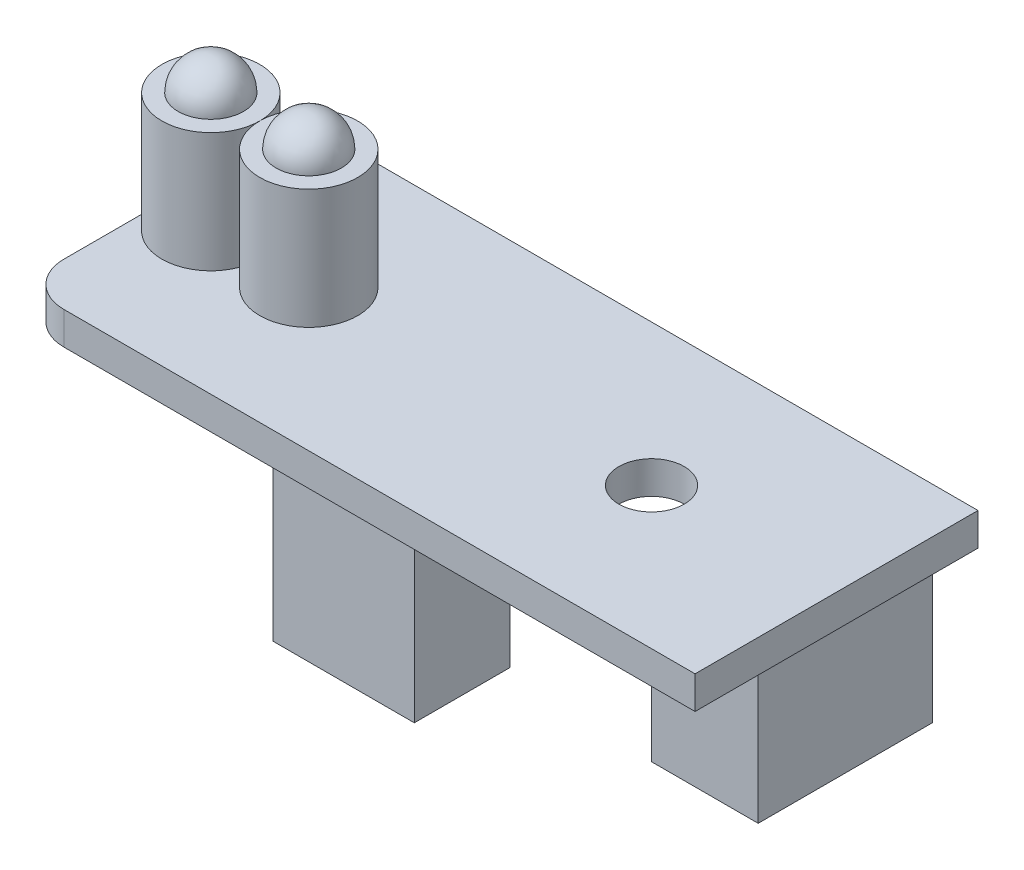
from build123d import *

# Parameters (mm, degrees)
SKETCH_1_W          = 31
SKETCH_1_H          = 13
EXTRUDE_1_DEPTH     = 1.5
FILLET_1_R          = 2
EXTRUDE_3_DEPTH     = 5.5
SKETCH_5_R          = 1.5
CUT_EXTRUDE_1_DEPTH = 5.5
SKETCH_6_W          = 6.5
SKETCH_6_H          = 4.5
EXTRUDE_4_DEPTH     = 7
SKETCH_7_W          = 4
SKETCH_7_H          = 5
EXTRUDE_5_DEPTH     = 1.5
SKETCH_8_W          = 5
SKETCH_8_H          = 8
EXTRUDE_6_DEPTH     = 6
SKETCH_9_W          = 4
SKETCH_9_H          = 7
CUT_EXTRUDE_2_DEPTH = 5
SKETCH_10_W         = 6.5
SKETCH_10_H         = 7
CUT_EXTRUDE_3_DEPTH = 0.1
SKETCH_11_W         = 8
SKETCH_11_H         = 6
CUT_EXTRUDE_4_DEPTH = 0.1


with BuildPart() as part:
    # Sketch 1 → Extrude 1 (new body)
    with BuildSketch(Plane(origin=(0, 0, 0), x_dir=(1, 0, 0), z_dir=(0, 1, 0))):
        Rectangle(SKETCH_1_W, SKETCH_1_H)
    extrude(amount=EXTRUDE_1_DEPTH)

    # Fillet 1
    fillet_1_edges = [part.edges().sort_by_distance(p)[0] for p in [
        (-15.5, 0.75, 6.5),
        (-15.5, 0.75, -6.5),
    ]]
    fillet(fillet_1_edges, radius=FILLET_1_R)

    # Sketch 5 → Cut-Extrude 1 (cut)
    with BuildSketch(Plane(origin=(0, 0, 0), x_dir=(-1, 0, 0), z_dir=(0, -1, 0))):
        with Locations(Location((-7, 0, 0), (0, 0, 90))):
            Circle(SKETCH_5_R)
    extrude(amount=-CUT_EXTRUDE_1_DEPTH, mode=Mode.SUBTRACT)

    # Sketch 6 → Extrude 4 (add)
    with BuildSketch(Plane.XZ):
        with Locations((-0.75, 4.25)):
            Rectangle(SKETCH_6_W, SKETCH_6_H)
    extrude(amount=EXTRUDE_4_DEPTH)

    # Sketch 7 → Extrude 5 (add)
    with BuildSketch(Plane.XZ):
        with Locations((-1, -2.60589519)):
            Rectangle(SKETCH_7_W, SKETCH_7_H)
    extrude(amount=EXTRUDE_5_DEPTH)

    # Sketch 8 → Extrude 6 (add)
    with BuildSketch(Plane.XZ):
        with Locations((13, -0.5)):
            Rectangle(SKETCH_8_W, SKETCH_8_H)
    extrude(amount=EXTRUDE_6_DEPTH)

    # Sketch 9 → Cut-Extrude 2 (cut)
    with BuildSketch(Plane.XZ.offset(6)):
        with Locations((13, -0.5)):
            Rectangle(SKETCH_9_W, SKETCH_9_H)
    extrude(amount=-CUT_EXTRUDE_2_DEPTH, mode=Mode.SUBTRACT)

    # Sketch 10 → Cut-Extrude 3 (cut)
    with BuildSketch(Plane.XY.offset(6.5)):
        with Locations((-0.75, -3.5)):
            Rectangle(SKETCH_10_W, SKETCH_10_H)
    extrude(amount=-CUT_EXTRUDE_3_DEPTH, mode=Mode.SUBTRACT)

    # Sketch 11 → Cut-Extrude 4 (cut)
    with BuildSketch(Plane(origin=(15.5, 0, 0), x_dir=(0, 0, -1), z_dir=(1, 0, 0))):
        with Locations((0.5, -3)):
            Rectangle(SKETCH_11_W, SKETCH_11_H)
    extrude(amount=-CUT_EXTRUDE_4_DEPTH, mode=Mode.SUBTRACT)


with BuildPart() as body_2:
    # Sketch 2 → Extrude 3 (new body)
    with BuildSketch(Plane(origin=(0, 1.5, 0), x_dir=(1, 0, 0), z_dir=(0, 1, 0))):
        with BuildLine():
            ThreePointArc((-11, 0), (-13.25, 2.25), (-15.5, 0))
            Line((-15.5, 0), (-11, 0))
        make_face()
        with BuildLine():
            Line((-11, 0), (-15.5, 0))
            ThreePointArc((-15.5, 0), (-13.25, -2.25), (-11, 0))
        make_face()
        with BuildLine():
            ThreePointArc((-11, 0), (-13.25, 2.25), (-15.5, 0))
            Line((-15.5, 0), (-11, 0))
        make_face()
        with BuildLine():
            Line((-11, 0), (-15.5, 0))
            ThreePointArc((-15.5, 0), (-13.25, -2.25), (-11, 0))
        make_face()
        with BuildLine():
            ThreePointArc((-6.5, 0), (-8.75, 2.25), (-11, 0))
            Line((-11, 0), (-6.5, 0))
        make_face()
        with BuildLine():
            Line((-6.5, 0), (-11, 0))
            ThreePointArc((-11, 0), (-8.75, -2.25), (-6.5, 0))
        make_face()
        with BuildLine():
            ThreePointArc((-6.5, 0), (-8.75, 2.25), (-11, 0))
            Line((-11, 0), (-6.5, 0))
        make_face()
        with BuildLine():
            Line((-6.5, 0), (-11, 0))
            ThreePointArc((-11, 0), (-8.75, -2.25), (-6.5, 0))
        make_face()
    extrude(amount=EXTRUDE_3_DEPTH)

    # Sketch 3 → Revolve 1 (revolve)
    with BuildSketch(Plane(origin=(0, 7, 0), x_dir=(1, 0, 0), z_dir=(0, 1, 0))):
        with BuildLine():
            Line((-13.25, 1.5), (-13.25, -1.5))
            ThreePointArc((-13.25, -1.5), (-14.75, 0), (-13.25, 1.5))
        make_face()
    revolve(axis=Axis((-13.25, 7, -1.5), (0, 0, 1)))

    # Sketch 4 → Revolve 2 (revolve)
    with BuildSketch(Plane(origin=(0, 7, 0), x_dir=(1, 0, 0), z_dir=(0, 1, 0))):
        with BuildLine():
            Line((-8.75, 1.5), (-8.75, -1.5))
            ThreePointArc((-8.75, -1.5), (-10.25, 0), (-8.75, 1.5))
        make_face()
    revolve(axis=Axis((-8.75, 7, -1.5), (0, 0, 1)))


solid = Compound([part.part, body_2.part])
